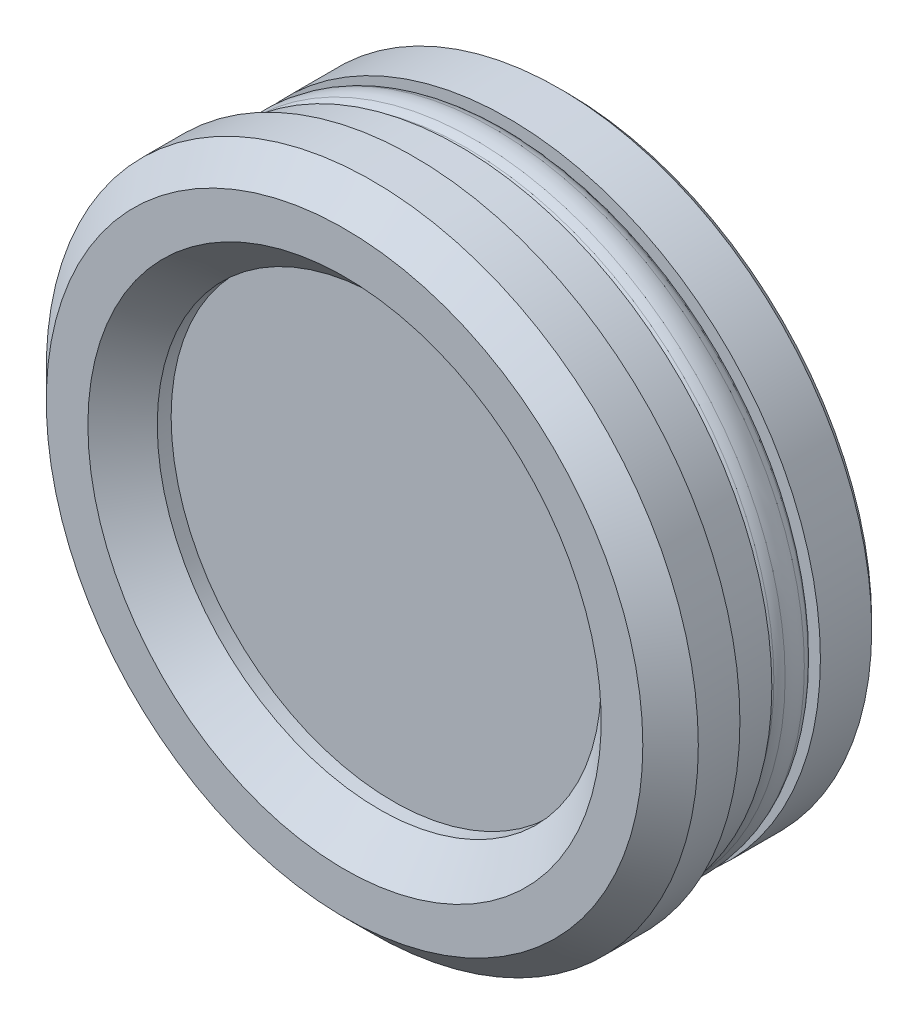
ISO-10303-21;
HEADER;
FILE_DESCRIPTION(('STEP AP214'),'2;1');
FILE_NAME('part.step','',(''),(''),'','','');
FILE_SCHEMA(('AUTOMOTIVE_DESIGN { 1 0 10303 214 1 1 1 1 }'));
ENDSEC;
DATA;
#1=APPLICATION_CONTEXT('core data for automotive mechanical design processes');
#2=APPLICATION_PROTOCOL_DEFINITION('international standard','automotive_design',2000,#1);
#3=PRODUCT_CONTEXT('',#1,'mechanical');
#4=PRODUCT('Part','Part','',(#3));
#5=PRODUCT_RELATED_PRODUCT_CATEGORY('part','',(#4));
#6=PRODUCT_DEFINITION_FORMATION('','',#4);
#7=PRODUCT_DEFINITION_CONTEXT('part definition',#1,'design');
#8=PRODUCT_DEFINITION('design','',#6,#7);
#9=PRODUCT_DEFINITION_SHAPE('','',#8);
#10=(LENGTH_UNIT() NAMED_UNIT(*) SI_UNIT(.MILLI.,.METRE.));
#11=(NAMED_UNIT(*) PLANE_ANGLE_UNIT() SI_UNIT($,.RADIAN.));
#12=(NAMED_UNIT(*) SI_UNIT($,.STERADIAN.) SOLID_ANGLE_UNIT());
#13=UNCERTAINTY_MEASURE_WITH_UNIT(LENGTH_MEASURE(1.E-05),#10,'distance_accuracy_value','');
#14=(GEOMETRIC_REPRESENTATION_CONTEXT(3) GLOBAL_UNCERTAINTY_ASSIGNED_CONTEXT((#13)) GLOBAL_UNIT_ASSIGNED_CONTEXT((#10,
#11,#12)) REPRESENTATION_CONTEXT('',''));
#15=CARTESIAN_POINT('',(0.,0.,0.));
#16=DIRECTION('',(0.,0.,1.));
#17=DIRECTION('',(1.,0.,0.));
#18=AXIS2_PLACEMENT_3D('',#15,#16,#17);
#19=CARTESIAN_POINT('',(0.,0.,-11.5));
#20=DIRECTION('',(0.,0.,-1.));
#21=DIRECTION('',(1.,0.,0.));
#22=AXIS2_PLACEMENT_3D('',#19,#20,#21);
#23=PLANE('',#22);
#24=CARTESIAN_POINT('',(0.,0.,-11.5));
#25=DIRECTION('',(0.,0.,-1.));
#26=DIRECTION('',(1.,0.,0.));
#27=AXIS2_PLACEMENT_3D('',#24,#25,#26);
#28=CIRCLE('',#27,20.5);
#29=CARTESIAN_POINT('',(20.5,0.,-11.5));
#30=VERTEX_POINT('',#29);
#31=EDGE_CURVE('E70',#30,#30,#28,.T.);
#32=ORIENTED_EDGE('',*,*,#31,.T.);
#33=EDGE_LOOP('',(#32));
#34=FACE_BOUND('',#33,.T.);
#35=ADVANCED_FACE('F12',(#34),#23,.T.);
#36=CARTESIAN_POINT('',(0.,0.,5.));
#37=DIRECTION('',(0.,0.,-1.));
#38=DIRECTION('',(1.,0.,0.));
#39=AXIS2_PLACEMENT_3D('',#36,#37,#38);
#40=PLANE('',#39);
#41=CARTESIAN_POINT('',(0.,0.,5.));
#42=DIRECTION('',(0.,0.,1.));
#43=DIRECTION('',(-1.,0.,0.));
#44=AXIS2_PLACEMENT_3D('',#41,#42,#43);
#45=CIRCLE('',#44,18.5);
#46=CARTESIAN_POINT('',(-18.5,0.,5.));
#47=VERTEX_POINT('',#46);
#48=EDGE_CURVE('E76',#47,#47,#45,.T.);
#49=ORIENTED_EDGE('',*,*,#48,.F.);
#50=EDGE_LOOP('',(#49));
#51=FACE_BOUND('',#50,.T.);
#52=CARTESIAN_POINT('',(0.,0.,5.));
#53=DIRECTION('',(0.,0.,-1.));
#54=DIRECTION('',(1.,0.,0.));
#55=AXIS2_PLACEMENT_3D('',#52,#53,#54);
#56=CIRCLE('',#55,21.5);
#57=CARTESIAN_POINT('',(21.5,0.,5.));
#58=VERTEX_POINT('',#57);
#59=EDGE_CURVE('E8',#58,#58,#56,.T.);
#60=ORIENTED_EDGE('',*,*,#59,.F.);
#61=EDGE_LOOP('',(#60));
#62=FACE_BOUND('',#61,.T.);
#63=ADVANCED_FACE('F92',(#51,#62),#40,.F.);
#64=CARTESIAN_POINT('',(0.,0.,5.));
#65=DIRECTION('',(0.,0.,-1.));
#66=DIRECTION('',(1.,0.,0.));
#67=AXIS2_PLACEMENT_3D('',#64,#65,#66);
#68=CONICAL_SURFACE('',#67,21.5,0.785398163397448);
#69=CARTESIAN_POINT('',(0.,0.,3.));
#70=DIRECTION('',(0.,0.,-1.));
#71=DIRECTION('',(1.,0.,0.));
#72=AXIS2_PLACEMENT_3D('',#69,#70,#71);
#73=CIRCLE('',#72,23.5);
#74=CARTESIAN_POINT('',(23.5,0.,3.));
#75=VERTEX_POINT('',#74);
#76=EDGE_CURVE('E18',#75,#75,#73,.T.);
#77=ORIENTED_EDGE('',*,*,#76,.F.);
#78=EDGE_LOOP('',(#77));
#79=FACE_BOUND('',#78,.T.);
#80=ORIENTED_EDGE('',*,*,#59,.T.);
#81=EDGE_LOOP('',(#80));
#82=FACE_BOUND('',#81,.T.);
#83=ADVANCED_FACE('F95',(#79,#82),#68,.T.);
#84=CARTESIAN_POINT('',(0.,0.,-15.8833189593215));
#85=DIRECTION('',(0.,0.,-1.));
#86=DIRECTION('',(1.,0.,0.));
#87=AXIS2_PLACEMENT_3D('',#84,#85,#86);
#88=CYLINDRICAL_SURFACE('',#87,23.5);
#89=CARTESIAN_POINT('',(0.,0.,0.));
#90=DIRECTION('',(0.,0.,-1.));
#91=DIRECTION('',(1.,0.,0.));
#92=AXIS2_PLACEMENT_3D('',#89,#90,#91);
#93=CIRCLE('',#92,23.5);
#94=CARTESIAN_POINT('',(23.5,0.,0.));
#95=VERTEX_POINT('',#94);
#96=EDGE_CURVE('E22',#95,#95,#93,.T.);
#97=ORIENTED_EDGE('',*,*,#96,.F.);
#98=EDGE_LOOP('',(#97));
#99=FACE_BOUND('',#98,.T.);
#100=ORIENTED_EDGE('',*,*,#76,.T.);
#101=EDGE_LOOP('',(#100));
#102=FACE_BOUND('',#101,.T.);
#103=ADVANCED_FACE('F102',(#99,#102),#88,.T.);
#104=CARTESIAN_POINT('',(0.,-22.5,0.));
#105=DIRECTION('',(0.,0.,-1.));
#106=DIRECTION('',(1.,0.,0.));
#107=AXIS2_PLACEMENT_3D('',#104,#105,#106);
#108=PLANE('',#107);
#109=ORIENTED_EDGE('',*,*,#96,.T.);
#110=EDGE_LOOP('',(#109));
#111=FACE_BOUND('',#110,.T.);
#112=CARTESIAN_POINT('',(0.,0.,0.));
#113=DIRECTION('',(0.,0.,-1.));
#114=DIRECTION('',(1.,0.,0.));
#115=AXIS2_PLACEMENT_3D('',#112,#113,#114);
#116=CIRCLE('',#115,22.5);
#117=CARTESIAN_POINT('',(22.5,0.,0.));
#118=VERTEX_POINT('',#117);
#119=EDGE_CURVE('E26',#118,#118,#116,.T.);
#120=ORIENTED_EDGE('',*,*,#119,.F.);
#121=EDGE_LOOP('',(#120));
#122=FACE_BOUND('',#121,.T.);
#123=ADVANCED_FACE('F109',(#111,#122),#108,.T.);
#124=CARTESIAN_POINT('',(0.,0.,-15.8833189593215));
#125=DIRECTION('',(0.,0.,-1.));
#126=DIRECTION('',(1.,0.,0.));
#127=AXIS2_PLACEMENT_3D('',#124,#125,#126);
#128=CYLINDRICAL_SURFACE('',#127,22.5);
#129=ORIENTED_EDGE('',*,*,#119,.T.);
#130=EDGE_LOOP('',(#129));
#131=FACE_BOUND('',#130,.T.);
#132=CARTESIAN_POINT('',(0.,0.,-3.3));
#133=DIRECTION('',(0.,0.,-1.));
#134=DIRECTION('',(1.,0.,0.));
#135=AXIS2_PLACEMENT_3D('',#132,#133,#134);
#136=CIRCLE('',#135,22.5);
#137=CARTESIAN_POINT('',(22.5,0.,-3.3));
#138=VERTEX_POINT('',#137);
#139=EDGE_CURVE('E31',#138,#138,#136,.T.);
#140=ORIENTED_EDGE('',*,*,#139,.F.);
#141=EDGE_LOOP('',(#140));
#142=FACE_BOUND('',#141,.T.);
#143=ADVANCED_FACE('F113',(#131,#142),#128,.T.);
#144=CARTESIAN_POINT('',(0.,-21.25,-3.3));
#145=DIRECTION('',(0.,0.,-1.));
#146=DIRECTION('',(1.,0.,0.));
#147=AXIS2_PLACEMENT_3D('',#144,#145,#146);
#148=PLANE('',#147);
#149=ORIENTED_EDGE('',*,*,#139,.T.);
#150=EDGE_LOOP('',(#149));
#151=FACE_BOUND('',#150,.T.);
#152=CARTESIAN_POINT('',(0.,0.,-3.3));
#153=DIRECTION('',(0.,0.,-1.));
#154=DIRECTION('',(1.,0.,0.));
#155=AXIS2_PLACEMENT_3D('',#152,#153,#154);
#156=CIRCLE('',#155,21.25);
#157=CARTESIAN_POINT('',(21.25,0.,-3.3));
#158=VERTEX_POINT('',#157);
#159=EDGE_CURVE('E34',#158,#158,#156,.T.);
#160=ORIENTED_EDGE('',*,*,#159,.F.);
#161=EDGE_LOOP('',(#160));
#162=FACE_BOUND('',#161,.T.);
#163=ADVANCED_FACE('F117',(#151,#162),#148,.T.);
#164=CARTESIAN_POINT('',(0.,0.,-4.2066284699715));
#165=DIRECTION('',(0.,0.,-1.));
#166=DIRECTION('',(1.,0.,0.));
#167=AXIS2_PLACEMENT_3D('',#164,#165,#166);
#168=TOROIDAL_SURFACE('',#167,21.25,0.906628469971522);
#169=CARTESIAN_POINT('',(0.,0.,-3.42233218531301));
#170=DIRECTION('',(0.,0.,-1.));
#171=DIRECTION('',(1.,0.,0.));
#172=AXIS2_PLACEMENT_3D('',#169,#170,#171);
#173=CIRCLE('',#172,21.7048126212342);
#174=CARTESIAN_POINT('',(21.7048126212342,0.,-3.42233218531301));
#175=VERTEX_POINT('',#174);
#176=EDGE_CURVE('E37',#175,#175,#173,.T.);
#177=ORIENTED_EDGE('',*,*,#176,.F.);
#178=EDGE_LOOP('',(#177));
#179=FACE_BOUND('',#178,.T.);
#180=ORIENTED_EDGE('',*,*,#159,.T.);
#181=EDGE_LOOP('',(#180));
#182=FACE_BOUND('',#181,.T.);
#183=ADVANCED_FACE('F121',(#179,#182),#168,.T.);
#184=CARTESIAN_POINT('',(0.,0.,-4.61169077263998));
#185=DIRECTION('',(0.,0.,-1.));
#186=DIRECTION('',(1.,0.,0.));
#187=AXIS2_PLACEMENT_3D('',#184,#185,#186);
#188=TOROIDAL_SURFACE('',#187,21.0151047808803,1.37487117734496);
#189=CARTESIAN_POINT('',(0.,0.,-3.8125631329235));
#190=DIRECTION('',(0.,0.,-1.));
#191=DIRECTION('',(1.,0.,0.));
#192=AXIS2_PLACEMENT_3D('',#189,#190,#191);
#193=CIRCLE('',#192,22.1338834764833);
#194=CARTESIAN_POINT('',(22.1338834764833,0.,-3.8125631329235));
#195=VERTEX_POINT('',#194);
#196=EDGE_CURVE('E40',#195,#195,#193,.T.);
#197=ORIENTED_EDGE('',*,*,#196,.F.);
#198=EDGE_LOOP('',(#197));
#199=FACE_BOUND('',#198,.T.);
#200=ORIENTED_EDGE('',*,*,#176,.T.);
#201=EDGE_LOOP('',(#200));
#202=FACE_BOUND('',#201,.T.);
#203=ADVANCED_FACE('F125',(#199,#202),#188,.T.);
#204=CARTESIAN_POINT('',(0.,0.,-4.87669282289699));
#205=DIRECTION('',(0.,0.,-1.));
#206=DIRECTION('',(1.,0.,0.));
#207=AXIS2_PLACEMENT_3D('',#204,#205,#206);
#208=TOROIDAL_SURFACE('',#207,20.6441019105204,1.83079794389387);
#209=CARTESIAN_POINT('',(0.,0.,-4.357277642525));
#210=DIRECTION('',(0.,0.,-1.));
#211=DIRECTION('',(1.,0.,0.));
#212=AXIS2_PLACEMENT_3D('',#209,#210,#211);
#213=CIRCLE('',#212,22.3996727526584);
#214=CARTESIAN_POINT('',(22.3996727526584,0.,-4.357277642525));
#215=VERTEX_POINT('',#214);
#216=EDGE_CURVE('E43',#215,#215,#213,.T.);
#217=ORIENTED_EDGE('',*,*,#216,.F.);
#218=EDGE_LOOP('',(#217));
#219=FACE_BOUND('',#218,.T.);
#220=ORIENTED_EDGE('',*,*,#196,.T.);
#221=EDGE_LOOP('',(#220));
#222=FACE_BOUND('',#221,.T.);
#223=ADVANCED_FACE('F129',(#219,#222),#208,.T.);
#224=CARTESIAN_POINT('',(0.,0.,-5.05));
#225=DIRECTION('',(0.,0.,-1.));
#226=DIRECTION('',(1.,0.,0.));
#227=AXIS2_PLACEMENT_3D('',#224,#225,#226);
#228=TOROIDAL_SURFACE('',#227,20.0583411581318,2.44165884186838);
#229=CARTESIAN_POINT('',(0.,0.,-5.742722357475));
#230=DIRECTION('',(0.,0.,-1.));
#231=DIRECTION('',(1.,0.,0.));
#232=AXIS2_PLACEMENT_3D('',#229,#230,#231);
#233=CIRCLE('',#232,22.3996727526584);
#234=CARTESIAN_POINT('',(22.3996727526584,0.,-5.742722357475));
#235=VERTEX_POINT('',#234);
#236=EDGE_CURVE('E46',#235,#235,#233,.T.);
#237=ORIENTED_EDGE('',*,*,#236,.F.);
#238=EDGE_LOOP('',(#237));
#239=FACE_BOUND('',#238,.T.);
#240=ORIENTED_EDGE('',*,*,#216,.T.);
#241=EDGE_LOOP('',(#240));
#242=FACE_BOUND('',#241,.T.);
#243=ADVANCED_FACE('F133',(#239,#242),#228,.T.);
#244=CARTESIAN_POINT('',(0.,0.,-5.22330717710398));
#245=DIRECTION('',(0.,0.,-1.));
#246=DIRECTION('',(1.,0.,0.));
#247=AXIS2_PLACEMENT_3D('',#244,#245,#246);
#248=TOROIDAL_SURFACE('',#247,20.6441019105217,1.83079794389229);
#249=CARTESIAN_POINT('',(0.,0.,-6.2874368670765));
#250=DIRECTION('',(0.,0.,-1.));
#251=DIRECTION('',(1.,0.,0.));
#252=AXIS2_PLACEMENT_3D('',#249,#250,#251);
#253=CIRCLE('',#252,22.1338834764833);
#254=CARTESIAN_POINT('',(22.1338834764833,0.,-6.2874368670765));
#255=VERTEX_POINT('',#254);
#256=EDGE_CURVE('E49',#255,#255,#253,.T.);
#257=ORIENTED_EDGE('',*,*,#256,.F.);
#258=EDGE_LOOP('',(#257));
#259=FACE_BOUND('',#258,.T.);
#260=ORIENTED_EDGE('',*,*,#236,.T.);
#261=EDGE_LOOP('',(#260));
#262=FACE_BOUND('',#261,.T.);
#263=ADVANCED_FACE('F137',(#259,#262),#248,.T.);
#264=CARTESIAN_POINT('',(0.,0.,-5.48830922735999));
#265=DIRECTION('',(0.,0.,-1.));
#266=DIRECTION('',(1.,0.,0.));
#267=AXIS2_PLACEMENT_3D('',#264,#265,#266);
#268=TOROIDAL_SURFACE('',#267,21.0151047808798,1.37487117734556);
#269=CARTESIAN_POINT('',(0.,0.,-6.67766781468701));
#270=DIRECTION('',(0.,0.,-1.));
#271=DIRECTION('',(1.,0.,0.));
#272=AXIS2_PLACEMENT_3D('',#269,#270,#271);
#273=CIRCLE('',#272,21.7048126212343);
#274=CARTESIAN_POINT('',(21.7048126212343,0.,-6.67766781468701));
#275=VERTEX_POINT('',#274);
#276=EDGE_CURVE('E52',#275,#275,#273,.T.);
#277=ORIENTED_EDGE('',*,*,#276,.F.);
#278=EDGE_LOOP('',(#277));
#279=FACE_BOUND('',#278,.T.);
#280=ORIENTED_EDGE('',*,*,#256,.T.);
#281=EDGE_LOOP('',(#280));
#282=FACE_BOUND('',#281,.T.);
#283=ADVANCED_FACE('F141',(#279,#282),#268,.T.);
#284=CARTESIAN_POINT('',(0.,0.,-5.89337153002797));
#285=DIRECTION('',(0.,0.,-1.));
#286=DIRECTION('',(1.,0.,0.));
#287=AXIS2_PLACEMENT_3D('',#284,#285,#286);
#288=TOROIDAL_SURFACE('',#287,21.25,0.906628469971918);
#289=CARTESIAN_POINT('',(0.,0.,-6.8));
#290=DIRECTION('',(0.,0.,-1.));
#291=DIRECTION('',(1.,0.,0.));
#292=AXIS2_PLACEMENT_3D('',#289,#290,#291);
#293=CIRCLE('',#292,21.25);
#294=CARTESIAN_POINT('',(21.25,0.,-6.8));
#295=VERTEX_POINT('',#294);
#296=EDGE_CURVE('E55',#295,#295,#293,.T.);
#297=ORIENTED_EDGE('',*,*,#296,.F.);
#298=EDGE_LOOP('',(#297));
#299=FACE_BOUND('',#298,.T.);
#300=ORIENTED_EDGE('',*,*,#276,.T.);
#301=EDGE_LOOP('',(#300));
#302=FACE_BOUND('',#301,.T.);
#303=ADVANCED_FACE('F145',(#299,#302),#288,.T.);
#304=CARTESIAN_POINT('',(0.,-21.25,-6.8));
#305=DIRECTION('',(0.,0.,-1.));
#306=DIRECTION('',(1.,0.,0.));
#307=AXIS2_PLACEMENT_3D('',#304,#305,#306);
#308=PLANE('',#307);
#309=CARTESIAN_POINT('',(0.,0.,-6.8));
#310=DIRECTION('',(0.,0.,-1.));
#311=DIRECTION('',(1.,0.,0.));
#312=AXIS2_PLACEMENT_3D('',#309,#310,#311);
#313=CIRCLE('',#312,22.5);
#314=CARTESIAN_POINT('',(22.5,0.,-6.8));
#315=VERTEX_POINT('',#314);
#316=EDGE_CURVE('E58',#315,#315,#313,.T.);
#317=ORIENTED_EDGE('',*,*,#316,.F.);
#318=EDGE_LOOP('',(#317));
#319=FACE_BOUND('',#318,.T.);
#320=ORIENTED_EDGE('',*,*,#296,.T.);
#321=EDGE_LOOP('',(#320));
#322=FACE_BOUND('',#321,.T.);
#323=ADVANCED_FACE('F149',(#319,#322),#308,.F.);
#324=CARTESIAN_POINT('',(0.,0.,-15.8833189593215));
#325=DIRECTION('',(0.,0.,-1.));
#326=DIRECTION('',(1.,0.,0.));
#327=AXIS2_PLACEMENT_3D('',#324,#325,#326);
#328=CYLINDRICAL_SURFACE('',#327,22.5);
#329=ORIENTED_EDGE('',*,*,#316,.T.);
#330=EDGE_LOOP('',(#329));
#331=FACE_BOUND('',#330,.T.);
#332=CARTESIAN_POINT('',(0.,0.,-10.5));
#333=DIRECTION('',(0.,0.,-1.));
#334=DIRECTION('',(1.,0.,0.));
#335=AXIS2_PLACEMENT_3D('',#332,#333,#334);
#336=CIRCLE('',#335,22.5);
#337=CARTESIAN_POINT('',(22.5,0.,-10.5));
#338=VERTEX_POINT('',#337);
#339=EDGE_CURVE('E61',#338,#338,#336,.T.);
#340=ORIENTED_EDGE('',*,*,#339,.F.);
#341=EDGE_LOOP('',(#340));
#342=FACE_BOUND('',#341,.T.);
#343=ADVANCED_FACE('F153',(#331,#342),#328,.T.);
#344=CARTESIAN_POINT('',(0.,0.,-11.));
#345=DIRECTION('',(0.,0.,1.));
#346=DIRECTION('',(-1.,0.,0.));
#347=AXIS2_PLACEMENT_3D('',#344,#345,#346);
#348=CONICAL_SURFACE('',#347,22.,0.785398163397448);
#349=ORIENTED_EDGE('',*,*,#339,.T.);
#350=EDGE_LOOP('',(#349));
#351=FACE_BOUND('',#350,.T.);
#352=CARTESIAN_POINT('',(0.,0.,-11.));
#353=DIRECTION('',(0.,0.,-1.));
#354=DIRECTION('',(1.,0.,0.));
#355=AXIS2_PLACEMENT_3D('',#352,#353,#354);
#356=CIRCLE('',#355,22.);
#357=CARTESIAN_POINT('',(22.,0.,-11.));
#358=VERTEX_POINT('',#357);
#359=EDGE_CURVE('E64',#358,#358,#356,.T.);
#360=ORIENTED_EDGE('',*,*,#359,.F.);
#361=EDGE_LOOP('',(#360));
#362=FACE_BOUND('',#361,.T.);
#363=ADVANCED_FACE('F157',(#351,#362),#348,.T.);
#364=CARTESIAN_POINT('',(0.,-20.5,-11.));
#365=DIRECTION('',(0.,0.,-1.));
#366=DIRECTION('',(1.,0.,0.));
#367=AXIS2_PLACEMENT_3D('',#364,#365,#366);
#368=PLANE('',#367);
#369=ORIENTED_EDGE('',*,*,#359,.T.);
#370=EDGE_LOOP('',(#369));
#371=FACE_BOUND('',#370,.T.);
#372=CARTESIAN_POINT('',(0.,0.,-11.));
#373=DIRECTION('',(0.,0.,-1.));
#374=DIRECTION('',(1.,0.,0.));
#375=AXIS2_PLACEMENT_3D('',#372,#373,#374);
#376=CIRCLE('',#375,20.5);
#377=CARTESIAN_POINT('',(20.5,0.,-11.));
#378=VERTEX_POINT('',#377);
#379=EDGE_CURVE('E67',#378,#378,#376,.T.);
#380=ORIENTED_EDGE('',*,*,#379,.F.);
#381=EDGE_LOOP('',(#380));
#382=FACE_BOUND('',#381,.T.);
#383=ADVANCED_FACE('F161',(#371,#382),#368,.T.);
#384=CARTESIAN_POINT('',(0.,0.,-15.8833189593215));
#385=DIRECTION('',(0.,0.,-1.));
#386=DIRECTION('',(1.,0.,0.));
#387=AXIS2_PLACEMENT_3D('',#384,#385,#386);
#388=CYLINDRICAL_SURFACE('',#387,20.5);
#389=ORIENTED_EDGE('',*,*,#379,.T.);
#390=EDGE_LOOP('',(#389));
#391=FACE_BOUND('',#390,.T.);
#392=ORIENTED_EDGE('',*,*,#31,.F.);
#393=EDGE_LOOP('',(#392));
#394=FACE_BOUND('',#393,.T.);
#395=ADVANCED_FACE('F165',(#391,#394),#388,.T.);
#396=CARTESIAN_POINT('',(0.,0.,9.55817458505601));
#397=DIRECTION('',(0.,0.,1.));
#398=DIRECTION('',(-1.,0.,0.));
#399=AXIS2_PLACEMENT_3D('',#396,#397,#398);
#400=CYLINDRICAL_SURFACE('',#399,16.);
#401=CARTESIAN_POINT('',(0.,0.,1.5));
#402=DIRECTION('',(0.,0.,1.));
#403=DIRECTION('',(-1.,0.,0.));
#404=AXIS2_PLACEMENT_3D('',#401,#402,#403);
#405=CIRCLE('',#404,16.);
#406=CARTESIAN_POINT('',(-16.,0.,1.5));
#407=VERTEX_POINT('',#406);
#408=EDGE_CURVE('E73',#407,#407,#405,.T.);
#409=ORIENTED_EDGE('',*,*,#408,.F.);
#410=EDGE_LOOP('',(#409));
#411=FACE_BOUND('',#410,.T.);
#412=CARTESIAN_POINT('',(0.,0.,2.5));
#413=DIRECTION('',(0.,0.,1.));
#414=DIRECTION('',(-1.,0.,0.));
#415=AXIS2_PLACEMENT_3D('',#412,#413,#414);
#416=CIRCLE('',#415,16.);
#417=CARTESIAN_POINT('',(-16.,0.,2.5));
#418=VERTEX_POINT('',#417);
#419=EDGE_CURVE('E79',#418,#418,#416,.T.);
#420=ORIENTED_EDGE('',*,*,#419,.T.);
#421=EDGE_LOOP('',(#420));
#422=FACE_BOUND('',#421,.T.);
#423=ADVANCED_FACE('F83',(#411,#422),#400,.F.);
#424=CARTESIAN_POINT('',(0.,-16.,1.5));
#425=DIRECTION('',(0.,0.,-1.));
#426=DIRECTION('',(1.,0.,0.));
#427=AXIS2_PLACEMENT_3D('',#424,#425,#426);
#428=PLANE('',#427);
#429=ORIENTED_EDGE('',*,*,#408,.T.);
#430=EDGE_LOOP('',(#429));
#431=FACE_BOUND('',#430,.T.);
#432=ADVANCED_FACE('F88',(#431),#428,.F.);
#433=CARTESIAN_POINT('',(0.,0.,5.));
#434=DIRECTION('',(0.,0.,1.));
#435=DIRECTION('',(-1.,0.,0.));
#436=AXIS2_PLACEMENT_3D('',#433,#434,#435);
#437=CONICAL_SURFACE('',#436,18.5,0.785398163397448);
#438=ORIENTED_EDGE('',*,*,#419,.F.);
#439=EDGE_LOOP('',(#438));
#440=FACE_BOUND('',#439,.T.);
#441=ORIENTED_EDGE('',*,*,#48,.T.);
#442=EDGE_LOOP('',(#441));
#443=FACE_BOUND('',#442,.T.);
#444=ADVANCED_FACE('F85',(#440,#443),#437,.F.);
#445=CLOSED_SHELL('',(#35,#63,#83,#103,#123,#143,#163,#183,#203,#223,#243,#263,#283,#303,#323,
#343,#363,#383,#395,#423,#432,#444));
#446=MANIFOLD_SOLID_BREP('B1',#445);
#447=ADVANCED_BREP_SHAPE_REPRESENTATION('',(#18,#446),#14);
#448=SHAPE_DEFINITION_REPRESENTATION(#9,#447);
ENDSEC;
END-ISO-10303-21;
